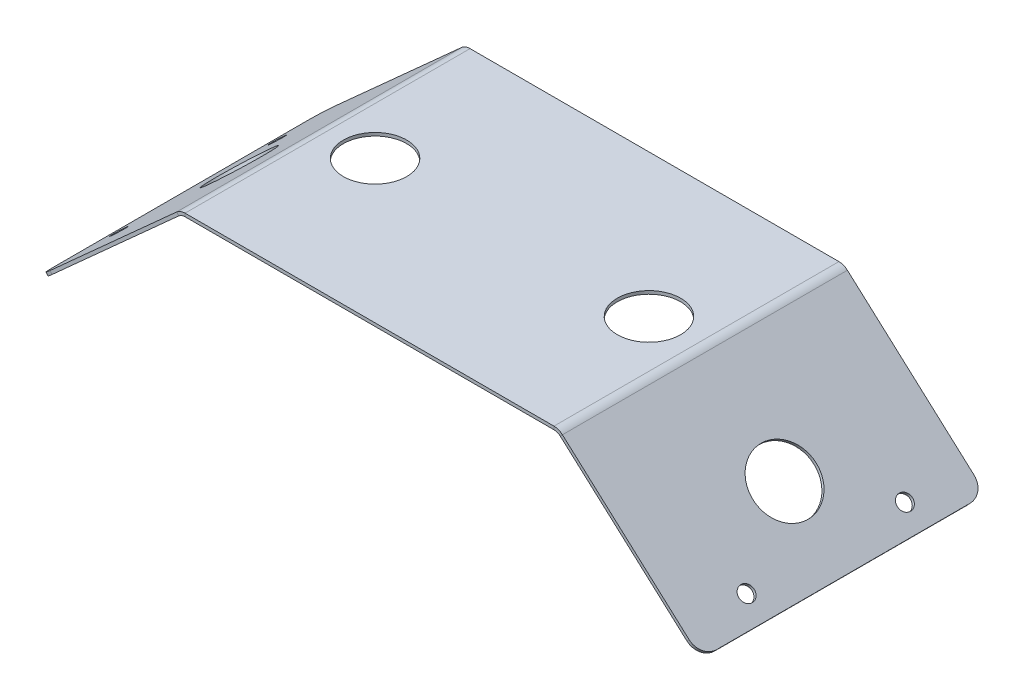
ISO-10303-21;
HEADER;
FILE_DESCRIPTION(('STEP AP214'),'2;1');
FILE_NAME('part.step','',(''),(''),'','','');
FILE_SCHEMA(('AUTOMOTIVE_DESIGN { 1 0 10303 214 1 1 1 1 }'));
ENDSEC;
DATA;
#1=APPLICATION_CONTEXT('core data for automotive mechanical design processes');
#2=APPLICATION_PROTOCOL_DEFINITION('international standard','automotive_design',2000,#1);
#3=PRODUCT_CONTEXT('',#1,'mechanical');
#4=PRODUCT('Part','Part','',(#3));
#5=PRODUCT_RELATED_PRODUCT_CATEGORY('part','',(#4));
#6=PRODUCT_DEFINITION_FORMATION('','',#4);
#7=PRODUCT_DEFINITION_CONTEXT('part definition',#1,'design');
#8=PRODUCT_DEFINITION('design','',#6,#7);
#9=PRODUCT_DEFINITION_SHAPE('','',#8);
#10=(LENGTH_UNIT() NAMED_UNIT(*) SI_UNIT(.MILLI.,.METRE.));
#11=(NAMED_UNIT(*) PLANE_ANGLE_UNIT() SI_UNIT($,.RADIAN.));
#12=(NAMED_UNIT(*) SI_UNIT($,.STERADIAN.) SOLID_ANGLE_UNIT());
#13=UNCERTAINTY_MEASURE_WITH_UNIT(LENGTH_MEASURE(1.E-05),#10,'distance_accuracy_value','');
#14=(GEOMETRIC_REPRESENTATION_CONTEXT(3) GLOBAL_UNCERTAINTY_ASSIGNED_CONTEXT((#13)) GLOBAL_UNIT_ASSIGNED_CONTEXT((#10,
#11,#12)) REPRESENTATION_CONTEXT('',''));
#15=CARTESIAN_POINT('',(0.,0.,0.));
#16=DIRECTION('',(0.,0.,1.));
#17=DIRECTION('',(1.,0.,0.));
#18=AXIS2_PLACEMENT_3D('',#15,#16,#17);
#19=CARTESIAN_POINT('',(-27.4040702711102,29.1563307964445,0.));
#20=DIRECTION('',(0.669130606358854,-0.743144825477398,0.));
#21=DIRECTION('',(0.743144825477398,0.669130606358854,0.));
#22=AXIS2_PLACEMENT_3D('',#19,#20,#21);
#23=PLANE('',#22);
#24=CARTESIAN_POINT('',(-99.0858260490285,-35.3862120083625,-25.));
#25=DIRECTION('',(0.669130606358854,-0.743144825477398,0.));
#26=DIRECTION('',(0.743144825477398,0.669130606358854,0.));
#27=AXIS2_PLACEMENT_3D('',#24,#25,#26);
#28=CIRCLE('',#27,2.39999999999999);
#29=CARTESIAN_POINT('',(-100.869373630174,-36.9921254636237,-25.));
#30=VERTEX_POINT('',#29);
#31=EDGE_CURVE('E775',#30,#30,#28,.T.);
#32=ORIENTED_EDGE('',*,*,#31,.T.);
#33=EDGE_LOOP('',(#32));
#34=FACE_BOUND('',#33,.T.);
#35=DIRECTION('',(-0.743144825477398,-0.669130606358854,0.));
#36=VECTOR('',#35,1.);
#37=CARTESIAN_POINT('',(-27.4040702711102,29.1563307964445,-45.));
#38=LINE('',#37,#36);
#39=CARTESIAN_POINT('',(-60.9265224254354,-1.02742069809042,-45.));
#40=VERTEX_POINT('',#39);
#41=CARTESIAN_POINT('',(-100.943688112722,-37.0590385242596,-45.));
#42=VERTEX_POINT('',#41);
#43=EDGE_CURVE('E214',#40,#42,#38,.T.);
#44=ORIENTED_EDGE('',*,*,#43,.T.);
#45=CARTESIAN_POINT('',(-100.943688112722,-37.0590385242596,-40.));
#46=DIRECTION('',(0.669130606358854,-0.743144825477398,0.));
#47=DIRECTION('',(0.743144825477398,0.669130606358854,0.));
#48=AXIS2_PLACEMENT_3D('',#45,#46,#47);
#49=CIRCLE('',#48,5.);
#50=CARTESIAN_POINT('',(-104.659412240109,-40.4046915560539,-40.));
#51=VERTEX_POINT('',#50);
#52=EDGE_CURVE('E83',#42,#51,#49,.F.);
#53=ORIENTED_EDGE('',*,*,#52,.T.);
#54=DIRECTION('',(0.,0.,1.));
#55=VECTOR('',#54,1.);
#56=CARTESIAN_POINT('',(-104.659412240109,-40.4046915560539,0.));
#57=LINE('',#56,#55);
#58=CARTESIAN_POINT('',(-104.659412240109,-40.4046915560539,40.));
#59=VERTEX_POINT('',#58);
#60=EDGE_CURVE('E220',#51,#59,#57,.T.);
#61=ORIENTED_EDGE('',*,*,#60,.T.);
#62=CARTESIAN_POINT('',(-100.943688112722,-37.0590385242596,40.));
#63=DIRECTION('',(0.669130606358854,-0.743144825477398,0.));
#64=DIRECTION('',(0.743144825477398,0.669130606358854,0.));
#65=AXIS2_PLACEMENT_3D('',#62,#63,#64);
#66=CIRCLE('',#65,5.);
#67=CARTESIAN_POINT('',(-100.943688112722,-37.0590385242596,45.));
#68=VERTEX_POINT('',#67);
#69=EDGE_CURVE('E90',#59,#68,#66,.F.);
#70=ORIENTED_EDGE('',*,*,#69,.T.);
#71=DIRECTION('',(0.743144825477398,0.669130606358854,0.));
#72=VECTOR('',#71,1.);
#73=CARTESIAN_POINT('',(-27.4040702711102,29.1563307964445,45.));
#74=LINE('',#73,#72);
#75=CARTESIAN_POINT('',(-60.9265224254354,-1.02742069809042,45.));
#76=VERTEX_POINT('',#75);
#77=EDGE_CURVE('E216',#68,#76,#74,.T.);
#78=ORIENTED_EDGE('',*,*,#77,.T.);
#79=DIRECTION('',(0.,0.,-1.));
#80=VECTOR('',#79,1.);
#81=CARTESIAN_POINT('',(-60.9265224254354,-1.02742069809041,45.));
#82=LINE('',#81,#80);
#83=EDGE_CURVE('E195',#40,#76,#82,.F.);
#84=ORIENTED_EDGE('',*,*,#83,.F.);
#85=EDGE_LOOP('',(#44,#53,#61,#70,#78,#84));
#86=FACE_BOUND('',#85,.T.);
#87=CARTESIAN_POINT('',(-99.0858260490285,-35.3862120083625,25.));
#88=DIRECTION('',(0.669130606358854,-0.743144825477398,0.));
#89=DIRECTION('',(0.743144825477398,0.669130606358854,0.));
#90=AXIS2_PLACEMENT_3D('',#87,#88,#89);
#91=CIRCLE('',#90,2.39999999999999);
#92=CARTESIAN_POINT('',(-100.869373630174,-36.9921254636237,25.));
#93=VERTEX_POINT('',#92);
#94=EDGE_CURVE('E780',#93,#93,#91,.T.);
#95=ORIENTED_EDGE('',*,*,#94,.T.);
#96=EDGE_LOOP('',(#95));
#97=FACE_BOUND('',#96,.T.);
#98=CARTESIAN_POINT('',(-86.080791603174,-23.6764263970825,0.));
#99=DIRECTION('',(0.669130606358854,-0.743144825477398,0.));
#100=DIRECTION('',(0.743144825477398,0.669130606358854,0.));
#101=AXIS2_PLACEMENT_3D('',#98,#99,#100);
#102=CIRCLE('',#101,10.);
#103=CARTESIAN_POINT('',(-93.512239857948,-30.367732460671,0.));
#104=VERTEX_POINT('',#103);
#105=EDGE_CURVE('E763',#104,#104,#102,.T.);
#106=ORIENTED_EDGE('',*,*,#105,.T.);
#107=EDGE_LOOP('',(#106));
#108=FACE_BOUND('',#107,.T.);
#109=ADVANCED_FACE('F75',(#34,#86,#97,#108),#23,.F.);
#110=CARTESIAN_POINT('',(-26.7349396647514,28.4131859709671,0.));
#111=DIRECTION('',(0.669130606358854,-0.743144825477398,0.));
#112=DIRECTION('',(0.743144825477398,0.669130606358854,0.));
#113=AXIS2_PLACEMENT_3D('',#110,#111,#112);
#114=PLANE('',#113);
#115=CARTESIAN_POINT('',(-98.4166954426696,-36.1293568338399,-25.));
#116=DIRECTION('',(0.669130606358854,-0.743144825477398,0.));
#117=DIRECTION('',(0.743144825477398,0.669130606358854,0.));
#118=AXIS2_PLACEMENT_3D('',#115,#116,#117);
#119=CIRCLE('',#118,2.39999999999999);
#120=CARTESIAN_POINT('',(-100.200243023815,-37.7352702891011,-25.));
#121=VERTEX_POINT('',#120);
#122=EDGE_CURVE('E777',#121,#121,#119,.T.);
#123=ORIENTED_EDGE('',*,*,#122,.F.);
#124=EDGE_LOOP('',(#123));
#125=FACE_BOUND('',#124,.T.);
#126=DIRECTION('',(0.,0.,-1.));
#127=VECTOR('',#126,1.);
#128=CARTESIAN_POINT('',(-103.99028163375,-41.1478363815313,45.));
#129=LINE('',#128,#127);
#130=CARTESIAN_POINT('',(-103.99028163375,-41.1478363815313,-40.));
#131=VERTEX_POINT('',#130);
#132=CARTESIAN_POINT('',(-103.99028163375,-41.1478363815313,40.));
#133=VERTEX_POINT('',#132);
#134=EDGE_CURVE('E224',#131,#133,#129,.F.);
#135=ORIENTED_EDGE('',*,*,#134,.F.);
#136=CARTESIAN_POINT('',(-100.274557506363,-37.802183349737,-40.));
#137=DIRECTION('',(0.669130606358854,-0.743144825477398,0.));
#138=DIRECTION('',(0.743144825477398,0.669130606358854,0.));
#139=AXIS2_PLACEMENT_3D('',#136,#137,#138);
#140=CIRCLE('',#139,5.);
#141=CARTESIAN_POINT('',(-100.274557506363,-37.802183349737,-45.));
#142=VERTEX_POINT('',#141);
#143=EDGE_CURVE('E335',#131,#142,#140,.T.);
#144=ORIENTED_EDGE('',*,*,#143,.T.);
#145=DIRECTION('',(0.743144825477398,0.669130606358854,0.));
#146=VECTOR('',#145,1.);
#147=CARTESIAN_POINT('',(-103.99028163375,-41.1478363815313,-45.));
#148=LINE('',#147,#146);
#149=CARTESIAN_POINT('',(-60.2573918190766,-1.77056552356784,-45.));
#150=VERTEX_POINT('',#149);
#151=EDGE_CURVE('E217',#150,#142,#148,.F.);
#152=ORIENTED_EDGE('',*,*,#151,.F.);
#153=DIRECTION('',(0.,0.,-1.));
#154=VECTOR('',#153,1.);
#155=CARTESIAN_POINT('',(-60.2573918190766,-1.77056552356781,45.));
#156=LINE('',#155,#154);
#157=CARTESIAN_POINT('',(-60.2573918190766,-1.77056552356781,45.));
#158=VERTEX_POINT('',#157);
#159=EDGE_CURVE('E211',#158,#150,#156,.T.);
#160=ORIENTED_EDGE('',*,*,#159,.F.);
#161=DIRECTION('',(-0.743144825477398,-0.669130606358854,0.));
#162=VECTOR('',#161,1.);
#163=CARTESIAN_POINT('',(-59.4015921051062,-1.00000000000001,45.));
#164=LINE('',#163,#162);
#165=CARTESIAN_POINT('',(-100.274557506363,-37.802183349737,45.));
#166=VERTEX_POINT('',#165);
#167=EDGE_CURVE('E221',#166,#158,#164,.F.);
#168=ORIENTED_EDGE('',*,*,#167,.F.);
#169=CARTESIAN_POINT('',(-100.274557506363,-37.802183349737,40.));
#170=DIRECTION('',(0.669130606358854,-0.743144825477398,0.));
#171=DIRECTION('',(0.743144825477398,0.669130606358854,0.));
#172=AXIS2_PLACEMENT_3D('',#169,#170,#171);
#173=CIRCLE('',#172,5.);
#174=EDGE_CURVE('E333',#166,#133,#173,.T.);
#175=ORIENTED_EDGE('',*,*,#174,.T.);
#176=EDGE_LOOP('',(#135,#144,#152,#160,#168,#175));
#177=FACE_BOUND('',#176,.T.);
#178=CARTESIAN_POINT('',(-98.4166954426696,-36.1293568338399,25.));
#179=DIRECTION('',(0.669130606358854,-0.743144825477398,0.));
#180=DIRECTION('',(0.743144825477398,0.669130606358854,0.));
#181=AXIS2_PLACEMENT_3D('',#178,#179,#180);
#182=CIRCLE('',#181,2.39999999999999);
#183=CARTESIAN_POINT('',(-100.200243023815,-37.7352702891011,25.));
#184=VERTEX_POINT('',#183);
#185=EDGE_CURVE('E783',#184,#184,#182,.T.);
#186=ORIENTED_EDGE('',*,*,#185,.F.);
#187=EDGE_LOOP('',(#186));
#188=FACE_BOUND('',#187,.T.);
#189=CARTESIAN_POINT('',(-85.4116609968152,-24.4195712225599,0.));
#190=DIRECTION('',(0.669130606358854,-0.743144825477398,0.));
#191=DIRECTION('',(0.743144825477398,0.669130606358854,0.));
#192=AXIS2_PLACEMENT_3D('',#189,#190,#191);
#193=CIRCLE('',#192,10.);
#194=CARTESIAN_POINT('',(-92.8431092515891,-31.1108772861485,0.));
#195=VERTEX_POINT('',#194);
#196=EDGE_CURVE('E767',#195,#195,#193,.T.);
#197=ORIENTED_EDGE('',*,*,#196,.F.);
#198=EDGE_LOOP('',(#197));
#199=FACE_BOUND('',#198,.T.);
#200=ADVANCED_FACE('F347',(#125,#177,#188,#199),#114,.T.);
#201=CARTESIAN_POINT('',(-58.25,-1.,45.));
#202=DIRECTION('',(0.,0.,1.));
#203=DIRECTION('',(1.,0.,0.));
#204=AXIS2_PLACEMENT_3D('',#201,#202,#203);
#205=PLANE('',#204);
#206=DIRECTION('',(1.,0.,0.));
#207=VECTOR('',#206,1.);
#208=CARTESIAN_POINT('',(-58.25,0.,45.));
#209=LINE('',#208,#207);
#210=CARTESIAN_POINT('',(-58.25,0.,45.));
#211=VERTEX_POINT('',#210);
#212=CARTESIAN_POINT('',(58.25,0.,45.));
#213=VERTEX_POINT('',#212);
#214=EDGE_CURVE('E283',#211,#213,#209,.T.);
#215=ORIENTED_EDGE('',*,*,#214,.F.);
#216=DIRECTION('',(0.,1.,0.));
#217=VECTOR('',#216,1.);
#218=CARTESIAN_POINT('',(-58.25,-1.,45.));
#219=LINE('',#218,#217);
#220=CARTESIAN_POINT('',(-58.25,-1.00000000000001,45.));
#221=VERTEX_POINT('',#220);
#222=EDGE_CURVE('E304',#221,#211,#219,.T.);
#223=ORIENTED_EDGE('',*,*,#222,.F.);
#224=DIRECTION('',(1.,0.,0.));
#225=VECTOR('',#224,1.);
#226=CARTESIAN_POINT('',(-58.25,-1.,45.));
#227=LINE('',#226,#225);
#228=CARTESIAN_POINT('',(58.25,-1.00000000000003,45.));
#229=VERTEX_POINT('',#228);
#230=EDGE_CURVE('E288',#221,#229,#227,.T.);
#231=ORIENTED_EDGE('',*,*,#230,.T.);
#232=DIRECTION('',(0.,1.,0.));
#233=VECTOR('',#232,1.);
#234=CARTESIAN_POINT('',(58.25,-1.,45.));
#235=LINE('',#234,#233);
#236=EDGE_CURVE('E300',#229,#213,#235,.T.);
#237=ORIENTED_EDGE('',*,*,#236,.T.);
#238=EDGE_LOOP('',(#215,#223,#231,#237));
#239=FACE_BOUND('',#238,.T.);
#240=ADVANCED_FACE('F366',(#239),#205,.T.);
#241=CARTESIAN_POINT('',(-58.25,-1.,-45.));
#242=DIRECTION('',(0.,0.,-1.));
#243=DIRECTION('',(-1.,0.,0.));
#244=AXIS2_PLACEMENT_3D('',#241,#242,#243);
#245=PLANE('',#244);
#246=DIRECTION('',(-1.,0.,0.));
#247=VECTOR('',#246,1.);
#248=CARTESIAN_POINT('',(-58.25,0.,-45.));
#249=LINE('',#248,#247);
#250=CARTESIAN_POINT('',(58.25,0.,-45.));
#251=VERTEX_POINT('',#250);
#252=CARTESIAN_POINT('',(-58.25,0.,-45.));
#253=VERTEX_POINT('',#252);
#254=EDGE_CURVE('E294',#251,#253,#249,.T.);
#255=ORIENTED_EDGE('',*,*,#254,.F.);
#256=DIRECTION('',(0.,1.,0.));
#257=VECTOR('',#256,1.);
#258=CARTESIAN_POINT('',(58.25,-1.,-45.));
#259=LINE('',#258,#257);
#260=CARTESIAN_POINT('',(58.25,-1.00000000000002,-44.9999999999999));
#261=VERTEX_POINT('',#260);
#262=EDGE_CURVE('E291',#261,#251,#259,.T.);
#263=ORIENTED_EDGE('',*,*,#262,.F.);
#264=DIRECTION('',(-1.,0.,0.));
#265=VECTOR('',#264,1.);
#266=CARTESIAN_POINT('',(-58.25,-1.,-45.));
#267=LINE('',#266,#265);
#268=CARTESIAN_POINT('',(-58.25,-1.00000000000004,-45.));
#269=VERTEX_POINT('',#268);
#270=EDGE_CURVE('E282',#261,#269,#267,.T.);
#271=ORIENTED_EDGE('',*,*,#270,.T.);
#272=DIRECTION('',(0.,1.,0.));
#273=VECTOR('',#272,1.);
#274=CARTESIAN_POINT('',(-58.25,-1.,-45.));
#275=LINE('',#274,#273);
#276=EDGE_CURVE('E307',#269,#253,#275,.T.);
#277=ORIENTED_EDGE('',*,*,#276,.T.);
#278=EDGE_LOOP('',(#255,#263,#271,#277));
#279=FACE_BOUND('',#278,.T.);
#280=ADVANCED_FACE('F382',(#279),#245,.T.);
#281=CARTESIAN_POINT('',(0.,-1.,0.));
#282=DIRECTION('',(0.,1.,0.));
#283=DIRECTION('',(0.,0.,1.));
#284=AXIS2_PLACEMENT_3D('',#281,#282,#283);
#285=PLANE('',#284);
#286=CARTESIAN_POINT('',(43.25,-1.,0.));
#287=DIRECTION('',(0.,1.,0.));
#288=DIRECTION('',(0.,0.,1.));
#289=AXIS2_PLACEMENT_3D('',#286,#287,#288);
#290=CIRCLE('',#289,10.);
#291=CARTESIAN_POINT('',(43.25,-1.,10.));
#292=VERTEX_POINT('',#291);
#293=EDGE_CURVE('E758',#292,#292,#290,.F.);
#294=ORIENTED_EDGE('',*,*,#293,.F.);
#295=EDGE_LOOP('',(#294));
#296=FACE_BOUND('',#295,.T.);
#297=CARTESIAN_POINT('',(-43.25,-1.,0.));
#298=DIRECTION('',(0.,1.,0.));
#299=DIRECTION('',(0.,0.,1.));
#300=AXIS2_PLACEMENT_3D('',#297,#298,#299);
#301=CIRCLE('',#300,10.);
#302=CARTESIAN_POINT('',(-43.25,-1.,10.));
#303=VERTEX_POINT('',#302);
#304=EDGE_CURVE('E761',#303,#303,#301,.F.);
#305=ORIENTED_EDGE('',*,*,#304,.F.);
#306=EDGE_LOOP('',(#305));
#307=FACE_BOUND('',#306,.T.);
#308=DIRECTION('',(0.,0.,-1.));
#309=VECTOR('',#308,1.);
#310=CARTESIAN_POINT('',(58.25,-1.,-45.));
#311=LINE('',#310,#309);
#312=EDGE_CURVE('E280',#229,#261,#311,.T.);
#313=ORIENTED_EDGE('',*,*,#312,.F.);
#314=ORIENTED_EDGE('',*,*,#230,.F.);
#315=DIRECTION('',(0.,0.,1.));
#316=VECTOR('',#315,1.);
#317=CARTESIAN_POINT('',(-58.25,-1.,-45.));
#318=LINE('',#317,#316);
#319=EDGE_CURVE('E286',#269,#221,#318,.T.);
#320=ORIENTED_EDGE('',*,*,#319,.F.);
#321=ORIENTED_EDGE('',*,*,#270,.F.);
#322=EDGE_LOOP('',(#313,#314,#320,#321));
#323=FACE_BOUND('',#322,.T.);
#324=ADVANCED_FACE('F369',(#296,#307,#323),#285,.F.);
#325=CARTESIAN_POINT('',(0.,0.,0.));
#326=DIRECTION('',(0.,1.,0.));
#327=DIRECTION('',(0.,0.,1.));
#328=AXIS2_PLACEMENT_3D('',#325,#326,#327);
#329=PLANE('',#328);
#330=CARTESIAN_POINT('',(43.25,0.,0.));
#331=DIRECTION('',(0.,1.,0.));
#332=DIRECTION('',(0.,0.,1.));
#333=AXIS2_PLACEMENT_3D('',#330,#331,#332);
#334=CIRCLE('',#333,10.);
#335=CARTESIAN_POINT('',(43.25,0.,10.));
#336=VERTEX_POINT('',#335);
#337=EDGE_CURVE('E825',#336,#336,#334,.T.);
#338=ORIENTED_EDGE('',*,*,#337,.F.);
#339=EDGE_LOOP('',(#338));
#340=FACE_BOUND('',#339,.T.);
#341=CARTESIAN_POINT('',(-43.25,0.,0.));
#342=DIRECTION('',(0.,1.,0.));
#343=DIRECTION('',(0.,0.,1.));
#344=AXIS2_PLACEMENT_3D('',#341,#342,#343);
#345=CIRCLE('',#344,10.);
#346=CARTESIAN_POINT('',(-43.25,0.,10.));
#347=VERTEX_POINT('',#346);
#348=EDGE_CURVE('E764',#347,#347,#345,.T.);
#349=ORIENTED_EDGE('',*,*,#348,.F.);
#350=EDGE_LOOP('',(#349));
#351=FACE_BOUND('',#350,.T.);
#352=DIRECTION('',(0.,0.,-1.));
#353=VECTOR('',#352,1.);
#354=CARTESIAN_POINT('',(58.25,0.,-45.));
#355=LINE('',#354,#353);
#356=EDGE_CURVE('E271',#213,#251,#355,.T.);
#357=ORIENTED_EDGE('',*,*,#356,.T.);
#358=ORIENTED_EDGE('',*,*,#254,.T.);
#359=DIRECTION('',(0.,0.,1.));
#360=VECTOR('',#359,1.);
#361=CARTESIAN_POINT('',(-58.25,0.,-45.));
#362=LINE('',#361,#360);
#363=EDGE_CURVE('E198',#253,#211,#362,.T.);
#364=ORIENTED_EDGE('',*,*,#363,.T.);
#365=ORIENTED_EDGE('',*,*,#214,.T.);
#366=EDGE_LOOP('',(#357,#358,#364,#365));
#367=FACE_BOUND('',#366,.T.);
#368=ADVANCED_FACE('F384',(#340,#351,#367),#329,.T.);
#369=CARTESIAN_POINT('',(58.25,-4.00000000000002,-44.9999999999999));
#370=DIRECTION('',(0.,0.,-1.));
#371=DIRECTION('',(0.,1.,0.));
#372=AXIS2_PLACEMENT_3D('',#369,#370,#371);
#373=PLANE('',#372);
#374=DIRECTION('',(-0.669130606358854,-0.743144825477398,0.));
#375=VECTOR('',#374,1.);
#376=CARTESIAN_POINT('',(60.9265224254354,-1.02742069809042,-45.));
#377=LINE('',#376,#375);
#378=CARTESIAN_POINT('',(60.2573918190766,-1.77056552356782,-44.9999999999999));
#379=VERTEX_POINT('',#378);
#380=CARTESIAN_POINT('',(60.9265224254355,-1.02742069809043,-44.9999999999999));
#381=VERTEX_POINT('',#380);
#382=EDGE_CURVE('E236',#379,#381,#377,.F.);
#383=ORIENTED_EDGE('',*,*,#382,.F.);
#384=CARTESIAN_POINT('',(58.25,-4.00000000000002,-44.9999999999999));
#385=DIRECTION('',(0.,0.,1.));
#386=DIRECTION('',(0.,-1.,0.));
#387=AXIS2_PLACEMENT_3D('',#384,#385,#386);
#388=CIRCLE('',#387,3.);
#389=EDGE_CURVE('E275',#261,#379,#388,.F.);
#390=ORIENTED_EDGE('',*,*,#389,.F.);
#391=ORIENTED_EDGE('',*,*,#262,.T.);
#392=CARTESIAN_POINT('',(58.25,-4.00000000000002,-44.9999999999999));
#393=DIRECTION('',(0.,0.,1.));
#394=DIRECTION('',(0.,-1.,0.));
#395=AXIS2_PLACEMENT_3D('',#392,#393,#394);
#396=CIRCLE('',#395,4.);
#397=EDGE_CURVE('E268',#251,#381,#396,.F.);
#398=ORIENTED_EDGE('',*,*,#397,.T.);
#399=EDGE_LOOP('',(#383,#390,#391,#398));
#400=FACE_BOUND('',#399,.T.);
#401=ADVANCED_FACE('F379',(#400),#373,.T.);
#402=CARTESIAN_POINT('',(58.25,-4.00000000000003,45.));
#403=DIRECTION('',(0.,0.,-1.));
#404=DIRECTION('',(0.,1.,0.));
#405=AXIS2_PLACEMENT_3D('',#402,#403,#404);
#406=PLANE('',#405);
#407=CARTESIAN_POINT('',(58.25,-4.00000000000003,45.));
#408=DIRECTION('',(0.,0.,1.));
#409=DIRECTION('',(0.,-1.,0.));
#410=AXIS2_PLACEMENT_3D('',#407,#408,#409);
#411=CIRCLE('',#410,3.);
#412=CARTESIAN_POINT('',(60.2573918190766,-1.77056552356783,45.));
#413=VERTEX_POINT('',#412);
#414=EDGE_CURVE('E243',#413,#229,#411,.T.);
#415=ORIENTED_EDGE('',*,*,#414,.F.);
#416=DIRECTION('',(-0.669130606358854,-0.743144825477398,0.));
#417=VECTOR('',#416,1.);
#418=CARTESIAN_POINT('',(60.2573918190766,-1.77056552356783,45.));
#419=LINE('',#418,#417);
#420=CARTESIAN_POINT('',(60.9265224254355,-1.02742069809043,45.));
#421=VERTEX_POINT('',#420);
#422=EDGE_CURVE('E261',#413,#421,#419,.F.);
#423=ORIENTED_EDGE('',*,*,#422,.T.);
#424=CARTESIAN_POINT('',(58.25,-4.00000000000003,45.));
#425=DIRECTION('',(0.,0.,1.));
#426=DIRECTION('',(0.,-1.,0.));
#427=AXIS2_PLACEMENT_3D('',#424,#425,#426);
#428=CIRCLE('',#427,4.);
#429=EDGE_CURVE('E272',#421,#213,#428,.T.);
#430=ORIENTED_EDGE('',*,*,#429,.T.);
#431=ORIENTED_EDGE('',*,*,#236,.F.);
#432=EDGE_LOOP('',(#415,#423,#430,#431));
#433=FACE_BOUND('',#432,.T.);
#434=ADVANCED_FACE('F388',(#433),#406,.F.);
#435=CARTESIAN_POINT('',(58.25,-4.00000000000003,45.));
#436=DIRECTION('',(0.,0.,1.));
#437=DIRECTION('',(0.669130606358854,0.743144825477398,0.));
#438=AXIS2_PLACEMENT_3D('',#435,#436,#437);
#439=CYLINDRICAL_SURFACE('',#438,4.);
#440=ORIENTED_EDGE('',*,*,#356,.F.);
#441=ORIENTED_EDGE('',*,*,#429,.F.);
#442=DIRECTION('',(0.,0.,1.));
#443=VECTOR('',#442,1.);
#444=CARTESIAN_POINT('',(60.9265224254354,-1.02742069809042,-45.));
#445=LINE('',#444,#443);
#446=EDGE_CURVE('E258',#421,#381,#445,.F.);
#447=ORIENTED_EDGE('',*,*,#446,.T.);
#448=ORIENTED_EDGE('',*,*,#397,.F.);
#449=EDGE_LOOP('',(#440,#441,#447,#448));
#450=FACE_BOUND('',#449,.T.);
#451=ADVANCED_FACE('F386',(#450),#439,.T.);
#452=CARTESIAN_POINT('',(58.25,-4.00000000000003,45.));
#453=DIRECTION('',(0.,0.,1.));
#454=DIRECTION('',(0.669130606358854,0.743144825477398,0.));
#455=AXIS2_PLACEMENT_3D('',#452,#453,#454);
#456=CYLINDRICAL_SURFACE('',#455,3.);
#457=ORIENTED_EDGE('',*,*,#312,.T.);
#458=ORIENTED_EDGE('',*,*,#389,.T.);
#459=DIRECTION('',(0.,0.,1.));
#460=VECTOR('',#459,1.);
#461=CARTESIAN_POINT('',(60.2573918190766,-1.77056552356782,-45.));
#462=LINE('',#461,#460);
#463=EDGE_CURVE('E264',#379,#413,#462,.T.);
#464=ORIENTED_EDGE('',*,*,#463,.T.);
#465=ORIENTED_EDGE('',*,*,#414,.T.);
#466=EDGE_LOOP('',(#457,#458,#464,#465));
#467=FACE_BOUND('',#466,.T.);
#468=ADVANCED_FACE('F373',(#467),#456,.F.);
#469=CARTESIAN_POINT('',(104.659412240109,-40.4046915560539,45.));
#470=DIRECTION('',(0.,0.,-1.));
#471=DIRECTION('',(-1.,0.,0.));
#472=AXIS2_PLACEMENT_3D('',#469,#470,#471);
#473=PLANE('',#472);
#474=DIRECTION('',(-0.743144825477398,0.669130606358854,0.));
#475=VECTOR('',#474,1.);
#476=CARTESIAN_POINT('',(103.99028163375,-41.1478363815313,45.));
#477=LINE('',#476,#475);
#478=CARTESIAN_POINT('',(100.274557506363,-37.802183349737,45.));
#479=VERTEX_POINT('',#478);
#480=EDGE_CURVE('E255',#413,#479,#477,.F.);
#481=ORIENTED_EDGE('',*,*,#480,.T.);
#482=DIRECTION('',(-0.669130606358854,-0.743144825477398,0.));
#483=VECTOR('',#482,1.);
#484=CARTESIAN_POINT('',(100.943688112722,-37.0590385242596,45.));
#485=LINE('',#484,#483);
#486=CARTESIAN_POINT('',(100.943688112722,-37.0590385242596,45.));
#487=VERTEX_POINT('',#486);
#488=EDGE_CURVE('E319',#479,#487,#485,.F.);
#489=ORIENTED_EDGE('',*,*,#488,.T.);
#490=DIRECTION('',(0.743144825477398,-0.669130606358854,0.));
#491=VECTOR('',#490,1.);
#492=CARTESIAN_POINT('',(27.4040702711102,29.1563307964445,45.));
#493=LINE('',#492,#491);
#494=EDGE_CURVE('E247',#421,#487,#493,.T.);
#495=ORIENTED_EDGE('',*,*,#494,.F.);
#496=ORIENTED_EDGE('',*,*,#422,.F.);
#497=EDGE_LOOP('',(#481,#489,#495,#496));
#498=FACE_BOUND('',#497,.T.);
#499=ADVANCED_FACE('F398',(#498),#473,.F.);
#500=CARTESIAN_POINT('',(60.0707227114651,-0.25685517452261,-45.));
#501=DIRECTION('',(0.,0.,1.));
#502=DIRECTION('',(0.,-1.,0.));
#503=AXIS2_PLACEMENT_3D('',#500,#501,#502);
#504=PLANE('',#503);
#505=DIRECTION('',(-0.743144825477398,0.669130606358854,0.));
#506=VECTOR('',#505,1.);
#507=CARTESIAN_POINT('',(27.4040702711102,29.1563307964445,-45.));
#508=LINE('',#507,#506);
#509=CARTESIAN_POINT('',(100.943688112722,-37.0590385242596,-45.));
#510=VERTEX_POINT('',#509);
#511=EDGE_CURVE('E241',#510,#381,#508,.T.);
#512=ORIENTED_EDGE('',*,*,#511,.F.);
#513=DIRECTION('',(-0.669130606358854,-0.743144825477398,0.));
#514=VECTOR('',#513,1.);
#515=CARTESIAN_POINT('',(100.943688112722,-37.0590385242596,-45.));
#516=LINE('',#515,#514);
#517=CARTESIAN_POINT('',(100.274557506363,-37.802183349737,-45.));
#518=VERTEX_POINT('',#517);
#519=EDGE_CURVE('E325',#510,#518,#516,.T.);
#520=ORIENTED_EDGE('',*,*,#519,.T.);
#521=DIRECTION('',(0.743144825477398,-0.669130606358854,0.));
#522=VECTOR('',#521,1.);
#523=CARTESIAN_POINT('',(59.4015921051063,-1.00000000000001,-45.));
#524=LINE('',#523,#522);
#525=EDGE_CURVE('E250',#518,#379,#524,.F.);
#526=ORIENTED_EDGE('',*,*,#525,.T.);
#527=ORIENTED_EDGE('',*,*,#382,.T.);
#528=EDGE_LOOP('',(#512,#520,#526,#527));
#529=FACE_BOUND('',#528,.T.);
#530=ADVANCED_FACE('F413',(#529),#504,.F.);
#531=CARTESIAN_POINT('',(27.4040702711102,29.1563307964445,0.));
#532=DIRECTION('',(-0.669130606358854,-0.743144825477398,0.));
#533=DIRECTION('',(0.743144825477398,-0.669130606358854,0.));
#534=AXIS2_PLACEMENT_3D('',#531,#532,#533);
#535=PLANE('',#534);
#536=CARTESIAN_POINT('',(86.080791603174,-23.6764263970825,0.));
#537=DIRECTION('',(0.669130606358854,0.743144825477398,0.));
#538=DIRECTION('',(-0.743144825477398,0.669130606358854,0.));
#539=AXIS2_PLACEMENT_3D('',#536,#537,#538);
#540=CIRCLE('',#539,10.);
#541=CARTESIAN_POINT('',(78.6493433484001,-16.985120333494,0.));
#542=VERTEX_POINT('',#541);
#543=EDGE_CURVE('E787',#542,#542,#540,.T.);
#544=ORIENTED_EDGE('',*,*,#543,.F.);
#545=EDGE_LOOP('',(#544));
#546=FACE_BOUND('',#545,.T.);
#547=CARTESIAN_POINT('',(99.0858260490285,-35.3862120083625,-25.));
#548=DIRECTION('',(0.669130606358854,0.743144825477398,0.));
#549=DIRECTION('',(-0.743144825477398,0.669130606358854,0.));
#550=AXIS2_PLACEMENT_3D('',#547,#548,#549);
#551=CIRCLE('',#550,2.39999999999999);
#552=CARTESIAN_POINT('',(97.3022784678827,-33.7802985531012,-25.));
#553=VERTEX_POINT('',#552);
#554=EDGE_CURVE('E792',#553,#553,#551,.T.);
#555=ORIENTED_EDGE('',*,*,#554,.F.);
#556=EDGE_LOOP('',(#555));
#557=FACE_BOUND('',#556,.T.);
#558=CARTESIAN_POINT('',(99.0858260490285,-35.3862120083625,25.));
#559=DIRECTION('',(0.669130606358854,0.743144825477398,0.));
#560=DIRECTION('',(-0.743144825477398,0.669130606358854,0.));
#561=AXIS2_PLACEMENT_3D('',#558,#559,#560);
#562=CIRCLE('',#561,2.39999999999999);
#563=CARTESIAN_POINT('',(97.3022784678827,-33.7802985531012,25.));
#564=VERTEX_POINT('',#563);
#565=EDGE_CURVE('E235',#564,#564,#562,.T.);
#566=ORIENTED_EDGE('',*,*,#565,.F.);
#567=EDGE_LOOP('',(#566));
#568=FACE_BOUND('',#567,.T.);
#569=ORIENTED_EDGE('',*,*,#494,.T.);
#570=CARTESIAN_POINT('',(100.943688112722,-37.0590385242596,40.));
#571=DIRECTION('',(-0.669130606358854,-0.743144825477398,0.));
#572=DIRECTION('',(0.743144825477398,-0.669130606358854,0.));
#573=AXIS2_PLACEMENT_3D('',#570,#571,#572);
#574=CIRCLE('',#573,5.);
#575=CARTESIAN_POINT('',(104.659412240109,-40.4046915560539,40.));
#576=VERTEX_POINT('',#575);
#577=EDGE_CURVE('E323',#487,#576,#574,.F.);
#578=ORIENTED_EDGE('',*,*,#577,.T.);
#579=DIRECTION('',(0.,0.,-1.));
#580=VECTOR('',#579,1.);
#581=CARTESIAN_POINT('',(104.659412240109,-40.4046915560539,0.));
#582=LINE('',#581,#580);
#583=CARTESIAN_POINT('',(104.659412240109,-40.4046915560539,-40.));
#584=VERTEX_POINT('',#583);
#585=EDGE_CURVE('E244',#576,#584,#582,.T.);
#586=ORIENTED_EDGE('',*,*,#585,.T.);
#587=CARTESIAN_POINT('',(100.943688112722,-37.0590385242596,-40.));
#588=DIRECTION('',(-0.669130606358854,-0.743144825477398,0.));
#589=DIRECTION('',(0.743144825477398,-0.669130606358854,0.));
#590=AXIS2_PLACEMENT_3D('',#587,#588,#589);
#591=CIRCLE('',#590,5.);
#592=EDGE_CURVE('E321',#584,#510,#591,.F.);
#593=ORIENTED_EDGE('',*,*,#592,.T.);
#594=ORIENTED_EDGE('',*,*,#511,.T.);
#595=ORIENTED_EDGE('',*,*,#446,.F.);
#596=EDGE_LOOP('',(#569,#578,#586,#593,#594,#595));
#597=FACE_BOUND('',#596,.T.);
#598=ADVANCED_FACE('F395',(#546,#557,#568,#597),#535,.F.);
#599=CARTESIAN_POINT('',(26.7349396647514,28.4131859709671,0.));
#600=DIRECTION('',(-0.669130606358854,-0.743144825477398,0.));
#601=DIRECTION('',(0.743144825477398,-0.669130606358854,0.));
#602=AXIS2_PLACEMENT_3D('',#599,#600,#601);
#603=PLANE('',#602);
#604=CARTESIAN_POINT('',(85.4116609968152,-24.4195712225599,0.));
#605=DIRECTION('',(-0.669130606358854,-0.743144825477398,0.));
#606=DIRECTION('',(0.743144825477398,-0.669130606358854,0.));
#607=AXIS2_PLACEMENT_3D('',#604,#605,#606);
#608=CIRCLE('',#607,10.);
#609=CARTESIAN_POINT('',(92.8431092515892,-31.1108772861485,0.));
#610=VERTEX_POINT('',#609);
#611=EDGE_CURVE('E786',#610,#610,#608,.F.);
#612=ORIENTED_EDGE('',*,*,#611,.T.);
#613=EDGE_LOOP('',(#612));
#614=FACE_BOUND('',#613,.T.);
#615=CARTESIAN_POINT('',(98.4166954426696,-36.1293568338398,-25.));
#616=DIRECTION('',(-0.669130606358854,-0.743144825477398,0.));
#617=DIRECTION('',(0.743144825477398,-0.669130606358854,0.));
#618=AXIS2_PLACEMENT_3D('',#615,#616,#617);
#619=CIRCLE('',#618,2.39999999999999);
#620=CARTESIAN_POINT('',(100.200243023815,-37.7352702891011,-25.));
#621=VERTEX_POINT('',#620);
#622=EDGE_CURVE('E790',#621,#621,#619,.F.);
#623=ORIENTED_EDGE('',*,*,#622,.T.);
#624=EDGE_LOOP('',(#623));
#625=FACE_BOUND('',#624,.T.);
#626=CARTESIAN_POINT('',(98.4166954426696,-36.1293568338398,25.));
#627=DIRECTION('',(-0.669130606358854,-0.743144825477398,0.));
#628=DIRECTION('',(0.743144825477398,-0.669130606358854,0.));
#629=AXIS2_PLACEMENT_3D('',#626,#627,#628);
#630=CIRCLE('',#629,2.39999999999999);
#631=CARTESIAN_POINT('',(100.200243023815,-37.7352702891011,25.));
#632=VERTEX_POINT('',#631);
#633=EDGE_CURVE('E795',#632,#632,#630,.F.);
#634=ORIENTED_EDGE('',*,*,#633,.T.);
#635=EDGE_LOOP('',(#634));
#636=FACE_BOUND('',#635,.T.);
#637=DIRECTION('',(0.,0.,1.));
#638=VECTOR('',#637,1.);
#639=CARTESIAN_POINT('',(103.99028163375,-41.1478363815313,-45.));
#640=LINE('',#639,#638);
#641=CARTESIAN_POINT('',(103.99028163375,-41.1478363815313,40.));
#642=VERTEX_POINT('',#641);
#643=CARTESIAN_POINT('',(103.99028163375,-41.1478363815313,-40.));
#644=VERTEX_POINT('',#643);
#645=EDGE_CURVE('E252',#642,#644,#640,.F.);
#646=ORIENTED_EDGE('',*,*,#645,.F.);
#647=CARTESIAN_POINT('',(100.274557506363,-37.802183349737,40.));
#648=DIRECTION('',(-0.669130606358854,-0.743144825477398,0.));
#649=DIRECTION('',(0.743144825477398,-0.669130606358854,0.));
#650=AXIS2_PLACEMENT_3D('',#647,#648,#649);
#651=CIRCLE('',#650,5.);
#652=EDGE_CURVE('E317',#642,#479,#651,.T.);
#653=ORIENTED_EDGE('',*,*,#652,.T.);
#654=ORIENTED_EDGE('',*,*,#480,.F.);
#655=ORIENTED_EDGE('',*,*,#463,.F.);
#656=ORIENTED_EDGE('',*,*,#525,.F.);
#657=CARTESIAN_POINT('',(100.274557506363,-37.802183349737,-40.));
#658=DIRECTION('',(-0.669130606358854,-0.743144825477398,0.));
#659=DIRECTION('',(0.743144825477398,-0.669130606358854,0.));
#660=AXIS2_PLACEMENT_3D('',#657,#658,#659);
#661=CIRCLE('',#660,5.);
#662=EDGE_CURVE('E315',#518,#644,#661,.T.);
#663=ORIENTED_EDGE('',*,*,#662,.T.);
#664=EDGE_LOOP('',(#646,#653,#654,#655,#656,#663));
#665=FACE_BOUND('',#664,.T.);
#666=ADVANCED_FACE('F416',(#614,#625,#636,#665),#603,.T.);
#667=CARTESIAN_POINT('',(104.659412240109,-40.4046915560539,-45.));
#668=DIRECTION('',(-0.743144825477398,0.669130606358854,0.));
#669=DIRECTION('',(-0.669130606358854,-0.743144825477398,0.));
#670=AXIS2_PLACEMENT_3D('',#667,#668,#669);
#671=PLANE('',#670);
#672=ORIENTED_EDGE('',*,*,#585,.F.);
#673=DIRECTION('',(-0.669130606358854,-0.743144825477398,0.));
#674=VECTOR('',#673,1.);
#675=CARTESIAN_POINT('',(104.659412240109,-40.4046915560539,40.));
#676=LINE('',#675,#674);
#677=EDGE_CURVE('E312',#576,#642,#676,.T.);
#678=ORIENTED_EDGE('',*,*,#677,.T.);
#679=ORIENTED_EDGE('',*,*,#645,.T.);
#680=DIRECTION('',(-0.669130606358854,-0.743144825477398,0.));
#681=VECTOR('',#680,1.);
#682=CARTESIAN_POINT('',(104.659412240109,-40.4046915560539,-40.));
#683=LINE('',#682,#681);
#684=EDGE_CURVE('E303',#644,#584,#683,.F.);
#685=ORIENTED_EDGE('',*,*,#684,.T.);
#686=EDGE_LOOP('',(#672,#678,#679,#685));
#687=FACE_BOUND('',#686,.T.);
#688=ADVANCED_FACE('F406',(#687),#671,.F.);
#689=CARTESIAN_POINT('',(-58.25,-4.,45.));
#690=DIRECTION('',(0.,0.,1.));
#691=DIRECTION('',(0.,-1.,0.));
#692=AXIS2_PLACEMENT_3D('',#689,#690,#691);
#693=PLANE('',#692);
#694=DIRECTION('',(0.669130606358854,-0.743144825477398,0.));
#695=VECTOR('',#694,1.);
#696=CARTESIAN_POINT('',(-60.9265224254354,-1.02742069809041,45.));
#697=LINE('',#696,#695);
#698=EDGE_CURVE('E232',#158,#76,#697,.F.);
#699=ORIENTED_EDGE('',*,*,#698,.F.);
#700=CARTESIAN_POINT('',(-58.25,-4.,45.));
#701=DIRECTION('',(0.,0.,-1.));
#702=DIRECTION('',(0.,1.,0.));
#703=AXIS2_PLACEMENT_3D('',#700,#701,#702);
#704=CIRCLE('',#703,2.99999999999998);
#705=EDGE_CURVE('E202',#221,#158,#704,.F.);
#706=ORIENTED_EDGE('',*,*,#705,.F.);
#707=ORIENTED_EDGE('',*,*,#222,.T.);
#708=CARTESIAN_POINT('',(-58.25,-4.,45.));
#709=DIRECTION('',(0.,0.,-1.));
#710=DIRECTION('',(0.,1.,0.));
#711=AXIS2_PLACEMENT_3D('',#708,#709,#710);
#712=CIRCLE('',#711,3.99999999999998);
#713=EDGE_CURVE('E201',#211,#76,#712,.F.);
#714=ORIENTED_EDGE('',*,*,#713,.T.);
#715=EDGE_LOOP('',(#699,#706,#707,#714));
#716=FACE_BOUND('',#715,.T.);
#717=ADVANCED_FACE('F362',(#716),#693,.T.);
#718=CARTESIAN_POINT('',(-58.25,-4.00000000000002,-45.));
#719=DIRECTION('',(0.,0.,1.));
#720=DIRECTION('',(0.,-1.,0.));
#721=AXIS2_PLACEMENT_3D('',#718,#719,#720);
#722=PLANE('',#721);
#723=CARTESIAN_POINT('',(-58.25,-4.00000000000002,-45.));
#724=DIRECTION('',(0.,0.,-1.));
#725=DIRECTION('',(0.,1.,0.));
#726=AXIS2_PLACEMENT_3D('',#723,#724,#725);
#727=CIRCLE('',#726,2.99999999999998);
#728=EDGE_CURVE('E209',#150,#269,#727,.T.);
#729=ORIENTED_EDGE('',*,*,#728,.F.);
#730=DIRECTION('',(0.669130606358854,-0.743144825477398,0.));
#731=VECTOR('',#730,1.);
#732=CARTESIAN_POINT('',(-60.2573918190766,-1.77056552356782,-45.));
#733=LINE('',#732,#731);
#734=EDGE_CURVE('E206',#150,#40,#733,.F.);
#735=ORIENTED_EDGE('',*,*,#734,.T.);
#736=CARTESIAN_POINT('',(-58.25,-4.00000000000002,-45.));
#737=DIRECTION('',(0.,0.,-1.));
#738=DIRECTION('',(0.,1.,0.));
#739=AXIS2_PLACEMENT_3D('',#736,#737,#738);
#740=CIRCLE('',#739,3.99999999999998);
#741=EDGE_CURVE('E191',#40,#253,#740,.T.);
#742=ORIENTED_EDGE('',*,*,#741,.T.);
#743=ORIENTED_EDGE('',*,*,#276,.F.);
#744=EDGE_LOOP('',(#729,#735,#742,#743));
#745=FACE_BOUND('',#744,.T.);
#746=ADVANCED_FACE('F207',(#745),#722,.F.);
#747=CARTESIAN_POINT('',(-58.25,-4.00000000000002,-45.));
#748=DIRECTION('',(0.,0.,-1.));
#749=DIRECTION('',(-0.669130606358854,0.743144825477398,0.));
#750=AXIS2_PLACEMENT_3D('',#747,#748,#749);
#751=CYLINDRICAL_SURFACE('',#750,3.99999999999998);
#752=ORIENTED_EDGE('',*,*,#363,.F.);
#753=ORIENTED_EDGE('',*,*,#741,.F.);
#754=ORIENTED_EDGE('',*,*,#83,.T.);
#755=ORIENTED_EDGE('',*,*,#713,.F.);
#756=EDGE_LOOP('',(#752,#753,#754,#755));
#757=FACE_BOUND('',#756,.T.);
#758=ADVANCED_FACE('F193',(#757),#751,.T.);
#759=CARTESIAN_POINT('',(-58.25,-4.00000000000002,-45.));
#760=DIRECTION('',(0.,0.,-1.));
#761=DIRECTION('',(-0.669130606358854,0.743144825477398,0.));
#762=AXIS2_PLACEMENT_3D('',#759,#760,#761);
#763=CYLINDRICAL_SURFACE('',#762,2.99999999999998);
#764=ORIENTED_EDGE('',*,*,#319,.T.);
#765=ORIENTED_EDGE('',*,*,#705,.T.);
#766=ORIENTED_EDGE('',*,*,#159,.T.);
#767=ORIENTED_EDGE('',*,*,#728,.T.);
#768=EDGE_LOOP('',(#764,#765,#766,#767));
#769=FACE_BOUND('',#768,.T.);
#770=ADVANCED_FACE('F357',(#769),#763,.F.);
#771=CARTESIAN_POINT('',(-104.659412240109,-40.4046915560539,-45.));
#772=DIRECTION('',(0.,0.,1.));
#773=DIRECTION('',(1.,0.,0.));
#774=AXIS2_PLACEMENT_3D('',#771,#772,#773);
#775=PLANE('',#774);
#776=ORIENTED_EDGE('',*,*,#151,.T.);
#777=DIRECTION('',(0.669130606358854,-0.743144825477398,0.));
#778=VECTOR('',#777,1.);
#779=CARTESIAN_POINT('',(-100.943688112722,-37.0590385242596,-45.));
#780=LINE('',#779,#778);
#781=EDGE_CURVE('E98',#142,#42,#780,.F.);
#782=ORIENTED_EDGE('',*,*,#781,.T.);
#783=ORIENTED_EDGE('',*,*,#43,.F.);
#784=ORIENTED_EDGE('',*,*,#734,.F.);
#785=EDGE_LOOP('',(#776,#782,#783,#784));
#786=FACE_BOUND('',#785,.T.);
#787=ADVANCED_FACE('F219',(#786),#775,.F.);
#788=CARTESIAN_POINT('',(-60.0707227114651,-0.25685517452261,45.));
#789=DIRECTION('',(0.,0.,-1.));
#790=DIRECTION('',(-1.,0.,0.));
#791=AXIS2_PLACEMENT_3D('',#788,#789,#790);
#792=PLANE('',#791);
#793=ORIENTED_EDGE('',*,*,#77,.F.);
#794=DIRECTION('',(0.669130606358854,-0.743144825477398,0.));
#795=VECTOR('',#794,1.);
#796=CARTESIAN_POINT('',(-100.943688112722,-37.0590385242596,45.));
#797=LINE('',#796,#795);
#798=EDGE_CURVE('E13',#68,#166,#797,.T.);
#799=ORIENTED_EDGE('',*,*,#798,.T.);
#800=ORIENTED_EDGE('',*,*,#167,.T.);
#801=ORIENTED_EDGE('',*,*,#698,.T.);
#802=EDGE_LOOP('',(#793,#799,#800,#801));
#803=FACE_BOUND('',#802,.T.);
#804=ADVANCED_FACE('F354',(#803),#792,.F.);
#805=CARTESIAN_POINT('',(-104.659412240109,-40.4046915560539,45.));
#806=DIRECTION('',(0.743144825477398,0.669130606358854,0.));
#807=DIRECTION('',(-0.669130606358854,0.743144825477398,0.));
#808=AXIS2_PLACEMENT_3D('',#805,#806,#807);
#809=PLANE('',#808);
#810=ORIENTED_EDGE('',*,*,#60,.F.);
#811=DIRECTION('',(0.669130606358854,-0.743144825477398,0.));
#812=VECTOR('',#811,1.);
#813=CARTESIAN_POINT('',(-104.659412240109,-40.4046915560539,-40.));
#814=LINE('',#813,#812);
#815=EDGE_CURVE('E330',#51,#131,#814,.T.);
#816=ORIENTED_EDGE('',*,*,#815,.T.);
#817=ORIENTED_EDGE('',*,*,#134,.T.);
#818=DIRECTION('',(0.669130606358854,-0.743144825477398,0.));
#819=VECTOR('',#818,1.);
#820=CARTESIAN_POINT('',(-104.659412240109,-40.4046915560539,40.));
#821=LINE('',#820,#819);
#822=EDGE_CURVE('E328',#133,#59,#821,.F.);
#823=ORIENTED_EDGE('',*,*,#822,.T.);
#824=EDGE_LOOP('',(#810,#816,#817,#823));
#825=FACE_BOUND('',#824,.T.);
#826=ADVANCED_FACE('F342',(#825),#809,.F.);
#827=CARTESIAN_POINT('',(4.99581943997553,-139.883750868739,25.));
#828=DIRECTION('',(0.669130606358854,0.743144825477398,0.));
#829=DIRECTION('',(-0.743144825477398,0.669130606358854,0.));
#830=AXIS2_PLACEMENT_3D('',#827,#828,#829);
#831=CYLINDRICAL_SURFACE('',#830,2.39999999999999);
#832=ORIENTED_EDGE('',*,*,#633,.F.);
#833=EDGE_LOOP('',(#832));
#834=FACE_BOUND('',#833,.T.);
#835=ORIENTED_EDGE('',*,*,#565,.T.);
#836=EDGE_LOOP('',(#835));
#837=FACE_BOUND('',#836,.T.);
#838=ADVANCED_FACE('F440',(#834,#837),#831,.F.);
#839=CARTESIAN_POINT('',(4.99581943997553,-139.883750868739,-25.));
#840=DIRECTION('',(0.669130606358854,0.743144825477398,0.));
#841=DIRECTION('',(-0.743144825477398,0.669130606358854,0.));
#842=AXIS2_PLACEMENT_3D('',#839,#840,#841);
#843=CYLINDRICAL_SURFACE('',#842,2.39999999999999);
#844=ORIENTED_EDGE('',*,*,#622,.F.);
#845=EDGE_LOOP('',(#844));
#846=FACE_BOUND('',#845,.T.);
#847=ORIENTED_EDGE('',*,*,#554,.T.);
#848=EDGE_LOOP('',(#847));
#849=FACE_BOUND('',#848,.T.);
#850=ADVANCED_FACE('F488',(#846,#849),#843,.F.);
#851=CARTESIAN_POINT('',(-8.00921500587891,-128.173965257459,0.));
#852=DIRECTION('',(0.669130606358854,0.743144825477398,0.));
#853=DIRECTION('',(-0.743144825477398,0.669130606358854,0.));
#854=AXIS2_PLACEMENT_3D('',#851,#852,#853);
#855=CYLINDRICAL_SURFACE('',#854,10.);
#856=ORIENTED_EDGE('',*,*,#611,.F.);
#857=EDGE_LOOP('',(#856));
#858=FACE_BOUND('',#857,.T.);
#859=ORIENTED_EDGE('',*,*,#543,.T.);
#860=EDGE_LOOP('',(#859));
#861=FACE_BOUND('',#860,.T.);
#862=ADVANCED_FACE('F495',(#858,#861),#855,.F.);
#863=CARTESIAN_POINT('',(-4.99581943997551,-139.883750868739,25.));
#864=DIRECTION('',(-0.669130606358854,0.743144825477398,0.));
#865=DIRECTION('',(-0.743144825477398,-0.669130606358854,0.));
#866=AXIS2_PLACEMENT_3D('',#863,#864,#865);
#867=CYLINDRICAL_SURFACE('',#866,2.39999999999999);
#868=CARTESIAN_POINT('',(-100.200243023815,-37.7352702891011,25.));
#869=CARTESIAN_POINT('',(-100.207213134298,-37.7275291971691,25.));
#870=CARTESIAN_POINT('',(-100.214183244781,-37.719788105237,25.));
#871=CARTESIAN_POINT('',(-100.228123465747,-37.7043059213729,25.));
#872=CARTESIAN_POINT('',(-100.23509357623,-37.6965648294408,25.));
#873=CARTESIAN_POINT('',(-100.249033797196,-37.6810826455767,25.));
#874=CARTESIAN_POINT('',(-100.256003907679,-37.6733415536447,25.));
#875=CARTESIAN_POINT('',(-100.269944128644,-37.6578593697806,25.));
#876=CARTESIAN_POINT('',(-100.276914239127,-37.6501182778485,25.));
#877=CARTESIAN_POINT('',(-100.290854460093,-37.6346360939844,25.));
#878=CARTESIAN_POINT('',(-100.297824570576,-37.6268950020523,25.));
#879=CARTESIAN_POINT('',(-100.311764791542,-37.6114128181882,25.));
#880=CARTESIAN_POINT('',(-100.318734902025,-37.6036717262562,25.));
#881=CARTESIAN_POINT('',(-100.332675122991,-37.5881895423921,25.));
#882=CARTESIAN_POINT('',(-100.339645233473,-37.58044845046,25.));
#883=CARTESIAN_POINT('',(-100.353585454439,-37.5649662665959,25.));
#884=CARTESIAN_POINT('',(-100.360555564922,-37.5572251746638,25.));
#885=CARTESIAN_POINT('',(-100.374495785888,-37.5417429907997,25.));
#886=CARTESIAN_POINT('',(-100.381465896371,-37.5340018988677,25.));
#887=CARTESIAN_POINT('',(-100.395406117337,-37.5185197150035,25.));
#888=CARTESIAN_POINT('',(-100.40237622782,-37.5107786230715,25.));
#889=CARTESIAN_POINT('',(-100.416316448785,-37.4952964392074,25.));
#890=CARTESIAN_POINT('',(-100.423286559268,-37.4875553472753,25.));
#891=CARTESIAN_POINT('',(-100.437226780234,-37.4720731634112,25.));
#892=CARTESIAN_POINT('',(-100.444196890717,-37.4643320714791,25.));
#893=CARTESIAN_POINT('',(-100.458137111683,-37.448849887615,25.));
#894=CARTESIAN_POINT('',(-100.465107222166,-37.441108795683,25.));
#895=CARTESIAN_POINT('',(-100.479047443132,-37.4256266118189,25.));
#896=CARTESIAN_POINT('',(-100.486017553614,-37.4178855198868,25.));
#897=CARTESIAN_POINT('',(-100.49995777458,-37.4024033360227,25.));
#898=CARTESIAN_POINT('',(-100.506927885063,-37.3946622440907,25.));
#899=CARTESIAN_POINT('',(-100.520868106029,-37.3791800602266,25.));
#900=CARTESIAN_POINT('',(-100.527838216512,-37.3714389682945,25.));
#901=CARTESIAN_POINT('',(-100.541778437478,-37.3559567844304,25.));
#902=CARTESIAN_POINT('',(-100.548748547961,-37.3482156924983,25.));
#903=CARTESIAN_POINT('',(-100.562688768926,-37.3327335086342,25.));
#904=CARTESIAN_POINT('',(-100.569658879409,-37.3249924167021,25.));
#905=CARTESIAN_POINT('',(-100.583599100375,-37.309510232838,25.));
#906=CARTESIAN_POINT('',(-100.590569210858,-37.301769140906,25.));
#907=CARTESIAN_POINT('',(-100.604509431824,-37.2862869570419,25.));
#908=CARTESIAN_POINT('',(-100.611479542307,-37.2785458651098,25.));
#909=CARTESIAN_POINT('',(-100.625419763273,-37.2630636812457,25.));
#910=CARTESIAN_POINT('',(-100.632389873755,-37.2553225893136,25.));
#911=CARTESIAN_POINT('',(-100.646330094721,-37.2398404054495,25.));
#912=CARTESIAN_POINT('',(-100.653300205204,-37.2320993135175,25.));
#913=CARTESIAN_POINT('',(-100.66724042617,-37.2166171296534,25.));
#914=CARTESIAN_POINT('',(-100.674210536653,-37.2088760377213,25.));
#915=CARTESIAN_POINT('',(-100.688150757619,-37.1933938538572,25.));
#916=CARTESIAN_POINT('',(-100.695120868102,-37.1856527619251,25.));
#917=CARTESIAN_POINT('',(-100.709061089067,-37.170170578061,25.));
#918=CARTESIAN_POINT('',(-100.71603119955,-37.162429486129,25.));
#919=CARTESIAN_POINT('',(-100.729971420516,-37.1469473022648,25.));
#920=CARTESIAN_POINT('',(-100.736941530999,-37.1392062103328,25.));
#921=CARTESIAN_POINT('',(-100.750881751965,-37.1237240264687,25.));
#922=CARTESIAN_POINT('',(-100.757851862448,-37.1159829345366,25.));
#923=CARTESIAN_POINT('',(-100.771792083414,-37.1005007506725,25.));
#924=CARTESIAN_POINT('',(-100.778762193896,-37.0927596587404,25.));
#925=CARTESIAN_POINT('',(-100.792702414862,-37.0772774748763,25.));
#926=CARTESIAN_POINT('',(-100.799672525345,-37.0695363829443,25.));
#927=CARTESIAN_POINT('',(-100.813612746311,-37.0540541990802,25.));
#928=CARTESIAN_POINT('',(-100.820582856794,-37.0463131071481,25.));
#929=CARTESIAN_POINT('',(-100.83452307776,-37.030830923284,25.));
#930=CARTESIAN_POINT('',(-100.841493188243,-37.023089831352,25.));
#931=CARTESIAN_POINT('',(-100.855433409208,-37.0076076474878,25.));
#932=CARTESIAN_POINT('',(-100.862403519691,-36.9998665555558,25.));
#933=CARTESIAN_POINT('',(-100.869373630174,-36.9921254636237,25.));
#934=B_SPLINE_CURVE_WITH_KNOTS('',3,(#868,#869,#870,#871,#872,#873,#874,#875,#876,#877,#878,
#879,#880,#881,#882,#883,#884,#885,#886,#887,#888,#889,#890,#891,#892,#893,#894,#895,#896,#897,
#898,#899,#900,#901,#902,#903,#904,#905,#906,#907,#908,#909,#910,#911,#912,#913,#914,#915,#916,
#917,#918,#919,#920,#921,#922,#923,#924,#925,#926,#927,#928,#929,#930,#931,#932,#933),
.UNSPECIFIED.,.F.,.F.,(4,2,2,2,2,2,2,2,2,2,2,2,2,2,2,2,2,2,2,2,2,2,2,2,2,2,2,2,2,2,2,2,4),(0.,
0.0312499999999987,0.0624999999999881,0.093749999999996,0.124999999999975,0.156249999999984,
0.187500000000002,0.218749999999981,0.24999999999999,0.281250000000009,0.312499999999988,
0.343750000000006,0.375000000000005,0.406249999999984,0.437500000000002,0.468749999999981,
0.49999999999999,0.531250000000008,0.562499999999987,0.593749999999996,0.624999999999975,
0.656249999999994,0.687499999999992,0.718749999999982,0.74999999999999,0.781249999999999,
0.812499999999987,0.843749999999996,0.875000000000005,0.906249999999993,0.937500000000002,
0.968749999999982,1.),.UNSPECIFIED.);
#935=EDGE_CURVE('BSEAM502',#184,#93,#934,.T.);
#936=ORIENTED_EDGE('',*,*,#185,.T.);
#937=ORIENTED_EDGE('',*,*,#94,.F.);
#938=ORIENTED_EDGE('',*,*,#935,.T.);
#939=ORIENTED_EDGE('',*,*,#935,.F.);
#940=EDGE_LOOP('',(#936,#938,#937,#939));
#941=FACE_BOUND('',#940,.T.);
#942=ADVANCED_FACE('F502',(#941),#867,.F.);
#943=CARTESIAN_POINT('',(-4.99581943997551,-139.883750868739,-25.));
#944=DIRECTION('',(-0.669130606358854,0.743144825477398,0.));
#945=DIRECTION('',(-0.743144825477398,-0.669130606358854,0.));
#946=AXIS2_PLACEMENT_3D('',#943,#944,#945);
#947=CYLINDRICAL_SURFACE('',#946,2.39999999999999);
#948=CARTESIAN_POINT('',(-100.200243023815,-37.7352702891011,-25.));
#949=CARTESIAN_POINT('',(-100.207213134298,-37.7275291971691,-25.));
#950=CARTESIAN_POINT('',(-100.214183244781,-37.719788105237,-25.));
#951=CARTESIAN_POINT('',(-100.228123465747,-37.7043059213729,-25.));
#952=CARTESIAN_POINT('',(-100.23509357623,-37.6965648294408,-25.));
#953=CARTESIAN_POINT('',(-100.249033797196,-37.6810826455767,-25.));
#954=CARTESIAN_POINT('',(-100.256003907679,-37.6733415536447,-25.));
#955=CARTESIAN_POINT('',(-100.269944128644,-37.6578593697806,-25.));
#956=CARTESIAN_POINT('',(-100.276914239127,-37.6501182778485,-25.));
#957=CARTESIAN_POINT('',(-100.290854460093,-37.6346360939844,-25.));
#958=CARTESIAN_POINT('',(-100.297824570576,-37.6268950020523,-25.));
#959=CARTESIAN_POINT('',(-100.311764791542,-37.6114128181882,-25.));
#960=CARTESIAN_POINT('',(-100.318734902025,-37.6036717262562,-25.));
#961=CARTESIAN_POINT('',(-100.332675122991,-37.5881895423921,-25.));
#962=CARTESIAN_POINT('',(-100.339645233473,-37.58044845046,-25.));
#963=CARTESIAN_POINT('',(-100.353585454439,-37.5649662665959,-25.));
#964=CARTESIAN_POINT('',(-100.360555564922,-37.5572251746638,-25.));
#965=CARTESIAN_POINT('',(-100.374495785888,-37.5417429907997,-25.));
#966=CARTESIAN_POINT('',(-100.381465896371,-37.5340018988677,-25.));
#967=CARTESIAN_POINT('',(-100.395406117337,-37.5185197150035,-25.));
#968=CARTESIAN_POINT('',(-100.40237622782,-37.5107786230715,-25.));
#969=CARTESIAN_POINT('',(-100.416316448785,-37.4952964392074,-25.));
#970=CARTESIAN_POINT('',(-100.423286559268,-37.4875553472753,-25.));
#971=CARTESIAN_POINT('',(-100.437226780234,-37.4720731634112,-25.));
#972=CARTESIAN_POINT('',(-100.444196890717,-37.4643320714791,-25.));
#973=CARTESIAN_POINT('',(-100.458137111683,-37.448849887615,-25.));
#974=CARTESIAN_POINT('',(-100.465107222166,-37.441108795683,-25.));
#975=CARTESIAN_POINT('',(-100.479047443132,-37.4256266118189,-25.));
#976=CARTESIAN_POINT('',(-100.486017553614,-37.4178855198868,-25.));
#977=CARTESIAN_POINT('',(-100.49995777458,-37.4024033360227,-25.));
#978=CARTESIAN_POINT('',(-100.506927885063,-37.3946622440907,-25.));
#979=CARTESIAN_POINT('',(-100.520868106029,-37.3791800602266,-25.));
#980=CARTESIAN_POINT('',(-100.527838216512,-37.3714389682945,-25.));
#981=CARTESIAN_POINT('',(-100.541778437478,-37.3559567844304,-25.));
#982=CARTESIAN_POINT('',(-100.548748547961,-37.3482156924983,-25.));
#983=CARTESIAN_POINT('',(-100.562688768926,-37.3327335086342,-25.));
#984=CARTESIAN_POINT('',(-100.569658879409,-37.3249924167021,-25.));
#985=CARTESIAN_POINT('',(-100.583599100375,-37.309510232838,-25.));
#986=CARTESIAN_POINT('',(-100.590569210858,-37.301769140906,-25.));
#987=CARTESIAN_POINT('',(-100.604509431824,-37.2862869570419,-25.));
#988=CARTESIAN_POINT('',(-100.611479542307,-37.2785458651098,-25.));
#989=CARTESIAN_POINT('',(-100.625419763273,-37.2630636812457,-25.));
#990=CARTESIAN_POINT('',(-100.632389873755,-37.2553225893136,-25.));
#991=CARTESIAN_POINT('',(-100.646330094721,-37.2398404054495,-25.));
#992=CARTESIAN_POINT('',(-100.653300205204,-37.2320993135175,-25.));
#993=CARTESIAN_POINT('',(-100.66724042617,-37.2166171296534,-25.));
#994=CARTESIAN_POINT('',(-100.674210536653,-37.2088760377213,-25.));
#995=CARTESIAN_POINT('',(-100.688150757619,-37.1933938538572,-25.));
#996=CARTESIAN_POINT('',(-100.695120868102,-37.1856527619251,-25.));
#997=CARTESIAN_POINT('',(-100.709061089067,-37.170170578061,-25.));
#998=CARTESIAN_POINT('',(-100.71603119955,-37.162429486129,-25.));
#999=CARTESIAN_POINT('',(-100.729971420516,-37.1469473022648,-25.));
#1000=CARTESIAN_POINT('',(-100.736941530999,-37.1392062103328,-25.));
#1001=CARTESIAN_POINT('',(-100.750881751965,-37.1237240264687,-25.));
#1002=CARTESIAN_POINT('',(-100.757851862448,-37.1159829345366,-25.));
#1003=CARTESIAN_POINT('',(-100.771792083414,-37.1005007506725,-25.));
#1004=CARTESIAN_POINT('',(-100.778762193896,-37.0927596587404,-25.));
#1005=CARTESIAN_POINT('',(-100.792702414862,-37.0772774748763,-25.));
#1006=CARTESIAN_POINT('',(-100.799672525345,-37.0695363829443,-25.));
#1007=CARTESIAN_POINT('',(-100.813612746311,-37.0540541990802,-25.));
#1008=CARTESIAN_POINT('',(-100.820582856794,-37.0463131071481,-25.));
#1009=CARTESIAN_POINT('',(-100.83452307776,-37.030830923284,-25.));
#1010=CARTESIAN_POINT('',(-100.841493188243,-37.023089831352,-25.));
#1011=CARTESIAN_POINT('',(-100.855433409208,-37.0076076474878,-25.));
#1012=CARTESIAN_POINT('',(-100.862403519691,-36.9998665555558,-25.));
#1013=CARTESIAN_POINT('',(-100.869373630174,-36.9921254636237,-25.));
#1014=B_SPLINE_CURVE_WITH_KNOTS('',3,(#948,#949,#950,#951,#952,#953,#954,#955,#956,#957,#958,
#959,#960,#961,#962,#963,#964,#965,#966,#967,#968,#969,#970,#971,#972,#973,#974,#975,#976,#977,
#978,#979,#980,#981,#982,#983,#984,#985,#986,#987,#988,#989,#990,#991,#992,#993,#994,#995,#996,
#997,#998,#999,#1000,#1001,#1002,#1003,#1004,#1005,#1006,#1007,#1008,#1009,#1010,#1011,#1012,
#1013),.UNSPECIFIED.,.F.,.F.,(4,2,2,2,2,2,2,2,2,2,2,2,2,2,2,2,2,2,2,2,2,2,2,2,2,2,2,2,2,2,2,2,
4),(0.,0.0312499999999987,0.0624999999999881,0.093749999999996,0.124999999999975,
0.156249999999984,0.187500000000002,0.218749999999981,0.24999999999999,0.281250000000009,
0.312499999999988,0.343750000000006,0.375000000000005,0.406249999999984,0.437500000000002,
0.468749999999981,0.49999999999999,0.531250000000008,0.562499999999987,0.593749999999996,
0.624999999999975,0.656249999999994,0.687499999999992,0.718749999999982,0.74999999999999,
0.781249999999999,0.812499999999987,0.843749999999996,0.875000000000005,0.906249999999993,
0.937500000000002,0.968749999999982,1.),.UNSPECIFIED.);
#1015=EDGE_CURVE('BSEAM510',#121,#30,#1014,.T.);
#1016=ORIENTED_EDGE('',*,*,#122,.T.);
#1017=ORIENTED_EDGE('',*,*,#31,.F.);
#1018=ORIENTED_EDGE('',*,*,#1015,.T.);
#1019=ORIENTED_EDGE('',*,*,#1015,.F.);
#1020=EDGE_LOOP('',(#1016,#1018,#1017,#1019));
#1021=FACE_BOUND('',#1020,.T.);
#1022=ADVANCED_FACE('F510',(#1021),#947,.F.);
#1023=CARTESIAN_POINT('',(8.00921500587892,-128.173965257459,0.));
#1024=DIRECTION('',(-0.669130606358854,0.743144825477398,0.));
#1025=DIRECTION('',(-0.743144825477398,-0.669130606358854,0.));
#1026=AXIS2_PLACEMENT_3D('',#1023,#1024,#1025);
#1027=CYLINDRICAL_SURFACE('',#1026,10.);
#1028=CARTESIAN_POINT('',(-92.8431092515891,-31.1108772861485,0.));
#1029=CARTESIAN_POINT('',(-92.850079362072,-31.1031361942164,0.));
#1030=CARTESIAN_POINT('',(-92.8570494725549,-31.0953951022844,0.));
#1031=CARTESIAN_POINT('',(-92.8709896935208,-31.0799129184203,0.));
#1032=CARTESIAN_POINT('',(-92.8779598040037,-31.0721718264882,0.));
#1033=CARTESIAN_POINT('',(-92.8919000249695,-31.0566896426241,0.));
#1034=CARTESIAN_POINT('',(-92.8988701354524,-31.048948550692,0.));
#1035=CARTESIAN_POINT('',(-92.9128103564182,-31.0334663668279,0.));
#1036=CARTESIAN_POINT('',(-92.9197804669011,-31.0257252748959,0.));
#1037=CARTESIAN_POINT('',(-92.9337206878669,-31.0102430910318,0.));
#1038=CARTESIAN_POINT('',(-92.9406907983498,-31.0025019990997,0.));
#1039=CARTESIAN_POINT('',(-92.9546310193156,-30.9870198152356,0.));
#1040=CARTESIAN_POINT('',(-92.9616011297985,-30.9792787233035,0.));
#1041=CARTESIAN_POINT('',(-92.9755413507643,-30.9637965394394,0.));
#1042=CARTESIAN_POINT('',(-92.9825114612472,-30.9560554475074,0.));
#1043=CARTESIAN_POINT('',(-92.9964516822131,-30.9405732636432,0.));
#1044=CARTESIAN_POINT('',(-93.003421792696,-30.9328321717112,0.));
#1045=CARTESIAN_POINT('',(-93.0173620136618,-30.9173499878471,0.));
#1046=CARTESIAN_POINT('',(-93.0243321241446,-30.909608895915,0.));
#1047=CARTESIAN_POINT('',(-93.0382723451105,-30.8941267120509,0.));
#1048=CARTESIAN_POINT('',(-93.0452424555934,-30.8863856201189,0.));
#1049=CARTESIAN_POINT('',(-93.0591826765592,-30.8709034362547,0.));
#1050=CARTESIAN_POINT('',(-93.0661527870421,-30.8631623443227,0.));
#1051=CARTESIAN_POINT('',(-93.0800930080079,-30.8476801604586,0.));
#1052=CARTESIAN_POINT('',(-93.0870631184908,-30.8399390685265,0.));
#1053=CARTESIAN_POINT('',(-93.1010033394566,-30.8244568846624,0.));
#1054=CARTESIAN_POINT('',(-93.1079734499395,-30.8167157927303,0.));
#1055=CARTESIAN_POINT('',(-93.1219136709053,-30.8012336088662,0.));
#1056=CARTESIAN_POINT('',(-93.1288837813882,-30.7934925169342,0.));
#1057=CARTESIAN_POINT('',(-93.142824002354,-30.7780103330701,0.));
#1058=CARTESIAN_POINT('',(-93.149794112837,-30.770269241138,0.));
#1059=CARTESIAN_POINT('',(-93.1637343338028,-30.7547870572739,0.));
#1060=CARTESIAN_POINT('',(-93.1707044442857,-30.7470459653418,0.));
#1061=CARTESIAN_POINT('',(-93.1846446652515,-30.7315637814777,0.));
#1062=CARTESIAN_POINT('',(-93.1916147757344,-30.7238226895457,0.));
#1063=CARTESIAN_POINT('',(-93.2055549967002,-30.7083405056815,0.));
#1064=CARTESIAN_POINT('',(-93.2125251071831,-30.7005994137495,0.));
#1065=CARTESIAN_POINT('',(-93.2264653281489,-30.6851172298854,0.));
#1066=CARTESIAN_POINT('',(-93.2334354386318,-30.6773761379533,0.));
#1067=CARTESIAN_POINT('',(-93.2473756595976,-30.6618939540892,0.));
#1068=CARTESIAN_POINT('',(-93.2543457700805,-30.6541528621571,0.));
#1069=CARTESIAN_POINT('',(-93.2682859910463,-30.638670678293,0.));
#1070=CARTESIAN_POINT('',(-93.2752561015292,-30.630929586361,0.));
#1071=CARTESIAN_POINT('',(-93.2891963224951,-30.6154474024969,0.));
#1072=CARTESIAN_POINT('',(-93.296166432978,-30.6077063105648,0.));
#1073=CARTESIAN_POINT('',(-93.3101066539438,-30.5922241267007,0.));
#1074=CARTESIAN_POINT('',(-93.3170767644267,-30.5844830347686,0.));
#1075=CARTESIAN_POINT('',(-93.3310169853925,-30.5690008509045,0.));
#1076=CARTESIAN_POINT('',(-93.3379870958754,-30.5612597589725,0.));
#1077=CARTESIAN_POINT('',(-93.3519273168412,-30.5457775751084,0.));
#1078=CARTESIAN_POINT('',(-93.3588974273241,-30.5380364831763,0.));
#1079=CARTESIAN_POINT('',(-93.3728376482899,-30.5225542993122,0.));
#1080=CARTESIAN_POINT('',(-93.3798077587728,-30.5148132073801,0.));
#1081=CARTESIAN_POINT('',(-93.3937479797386,-30.499331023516,0.));
#1082=CARTESIAN_POINT('',(-93.4007180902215,-30.491589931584,0.));
#1083=CARTESIAN_POINT('',(-93.4146583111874,-30.4761077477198,0.));
#1084=CARTESIAN_POINT('',(-93.4216284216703,-30.4683666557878,0.));
#1085=CARTESIAN_POINT('',(-93.4355686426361,-30.4528844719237,0.));
#1086=CARTESIAN_POINT('',(-93.442538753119,-30.4451433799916,0.));
#1087=CARTESIAN_POINT('',(-93.4564789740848,-30.4296611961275,0.));
#1088=CARTESIAN_POINT('',(-93.4634490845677,-30.4219201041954,0.));
#1089=CARTESIAN_POINT('',(-93.4773893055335,-30.4064379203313,0.));
#1090=CARTESIAN_POINT('',(-93.4843594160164,-30.3986968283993,0.));
#1091=CARTESIAN_POINT('',(-93.4982996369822,-30.3832146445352,0.));
#1092=CARTESIAN_POINT('',(-93.5052697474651,-30.3754735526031,0.));
#1093=CARTESIAN_POINT('',(-93.512239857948,-30.367732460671,0.));
#1094=B_SPLINE_CURVE_WITH_KNOTS('',3,(#1028,#1029,#1030,#1031,#1032,#1033,#1034,#1035,#1036,
#1037,#1038,#1039,#1040,#1041,#1042,#1043,#1044,#1045,#1046,#1047,#1048,#1049,#1050,#1051,#1052,
#1053,#1054,#1055,#1056,#1057,#1058,#1059,#1060,#1061,#1062,#1063,#1064,#1065,#1066,#1067,#1068,
#1069,#1070,#1071,#1072,#1073,#1074,#1075,#1076,#1077,#1078,#1079,#1080,#1081,#1082,#1083,#1084,
#1085,#1086,#1087,#1088,#1089,#1090,#1091,#1092,#1093),.UNSPECIFIED.,.F.,.F.,(4,2,2,2,2,2,2,2,2,
2,2,2,2,2,2,2,2,2,2,2,2,2,2,2,2,2,2,2,2,2,2,2,4),(0.,0.031250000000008,0.0624999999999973,
0.093749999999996,0.125000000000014,0.156249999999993,0.187500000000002,0.218750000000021,
0.250000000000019,0.281250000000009,0.312500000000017,0.343750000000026,0.375000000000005,
0.406250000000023,0.437500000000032,0.468750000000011,0.500000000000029,0.531250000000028,
0.562500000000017,0.593750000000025,0.625000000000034,0.656250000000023,0.687500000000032,
0.718750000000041,0.750000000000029,0.781250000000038,0.812500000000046,0.843750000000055,
0.875000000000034,0.906250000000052,0.937500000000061,0.96875000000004,1.00000000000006),.UNSPECIFIED.);
#1095=EDGE_CURVE('BSEAM518',#195,#104,#1094,.T.);
#1096=ORIENTED_EDGE('',*,*,#196,.T.);
#1097=ORIENTED_EDGE('',*,*,#105,.F.);
#1098=ORIENTED_EDGE('',*,*,#1095,.T.);
#1099=ORIENTED_EDGE('',*,*,#1095,.F.);
#1100=EDGE_LOOP('',(#1096,#1098,#1097,#1099));
#1101=FACE_BOUND('',#1100,.T.);
#1102=ADVANCED_FACE('F518',(#1101),#1027,.F.);
#1103=CARTESIAN_POINT('',(100.943688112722,-37.0590385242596,40.));
#1104=DIRECTION('',(-0.669130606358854,-0.743144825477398,0.));
#1105=DIRECTION('',(0.743144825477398,-0.669130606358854,0.));
#1106=AXIS2_PLACEMENT_3D('',#1103,#1104,#1105);
#1107=CYLINDRICAL_SURFACE('',#1106,5.);
#1108=ORIENTED_EDGE('',*,*,#577,.F.);
#1109=ORIENTED_EDGE('',*,*,#488,.F.);
#1110=ORIENTED_EDGE('',*,*,#652,.F.);
#1111=ORIENTED_EDGE('',*,*,#677,.F.);
#1112=EDGE_LOOP('',(#1108,#1109,#1110,#1111));
#1113=FACE_BOUND('',#1112,.T.);
#1114=ADVANCED_FACE('F401',(#1113),#1107,.T.);
#1115=CARTESIAN_POINT('',(100.943688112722,-37.0590385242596,-40.));
#1116=DIRECTION('',(-0.669130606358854,-0.743144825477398,0.));
#1117=DIRECTION('',(0.743144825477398,-0.669130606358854,0.));
#1118=AXIS2_PLACEMENT_3D('',#1115,#1116,#1117);
#1119=CYLINDRICAL_SURFACE('',#1118,5.);
#1120=ORIENTED_EDGE('',*,*,#592,.F.);
#1121=ORIENTED_EDGE('',*,*,#684,.F.);
#1122=ORIENTED_EDGE('',*,*,#662,.F.);
#1123=ORIENTED_EDGE('',*,*,#519,.F.);
#1124=EDGE_LOOP('',(#1120,#1121,#1122,#1123));
#1125=FACE_BOUND('',#1124,.T.);
#1126=ADVANCED_FACE('F410',(#1125),#1119,.T.);
#1127=CARTESIAN_POINT('',(-100.943688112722,-37.0590385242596,-40.));
#1128=DIRECTION('',(0.669130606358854,-0.743144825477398,0.));
#1129=DIRECTION('',(0.743144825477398,0.669130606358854,0.));
#1130=AXIS2_PLACEMENT_3D('',#1127,#1128,#1129);
#1131=CYLINDRICAL_SURFACE('',#1130,5.);
#1132=ORIENTED_EDGE('',*,*,#52,.F.);
#1133=ORIENTED_EDGE('',*,*,#781,.F.);
#1134=ORIENTED_EDGE('',*,*,#143,.F.);
#1135=ORIENTED_EDGE('',*,*,#815,.F.);
#1136=EDGE_LOOP('',(#1132,#1133,#1134,#1135));
#1137=FACE_BOUND('',#1136,.T.);
#1138=ADVANCED_FACE('F345',(#1137),#1131,.T.);
#1139=CARTESIAN_POINT('',(-100.943688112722,-37.0590385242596,40.));
#1140=DIRECTION('',(0.669130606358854,-0.743144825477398,0.));
#1141=DIRECTION('',(0.743144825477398,0.669130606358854,0.));
#1142=AXIS2_PLACEMENT_3D('',#1139,#1140,#1141);
#1143=CYLINDRICAL_SURFACE('',#1142,5.);
#1144=ORIENTED_EDGE('',*,*,#69,.F.);
#1145=ORIENTED_EDGE('',*,*,#822,.F.);
#1146=ORIENTED_EDGE('',*,*,#174,.F.);
#1147=ORIENTED_EDGE('',*,*,#798,.F.);
#1148=EDGE_LOOP('',(#1144,#1145,#1146,#1147));
#1149=FACE_BOUND('',#1148,.T.);
#1150=ADVANCED_FACE('F77',(#1149),#1143,.T.);
#1151=CARTESIAN_POINT('',(-43.25,-41.1488363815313,0.));
#1152=DIRECTION('',(0.,1.,0.));
#1153=DIRECTION('',(0.,0.,1.));
#1154=AXIS2_PLACEMENT_3D('',#1151,#1152,#1153);
#1155=CYLINDRICAL_SURFACE('',#1154,10.);
#1156=ORIENTED_EDGE('',*,*,#348,.T.);
#1157=EDGE_LOOP('',(#1156));
#1158=FACE_BOUND('',#1157,.T.);
#1159=ORIENTED_EDGE('',*,*,#304,.T.);
#1160=EDGE_LOOP('',(#1159));
#1161=FACE_BOUND('',#1160,.T.);
#1162=ADVANCED_FACE('F549',(#1158,#1161),#1155,.F.);
#1163=CARTESIAN_POINT('',(43.25,-41.1488363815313,0.));
#1164=DIRECTION('',(0.,1.,0.));
#1165=DIRECTION('',(0.,0.,1.));
#1166=AXIS2_PLACEMENT_3D('',#1163,#1164,#1165);
#1167=CYLINDRICAL_SURFACE('',#1166,10.);
#1168=ORIENTED_EDGE('',*,*,#337,.T.);
#1169=EDGE_LOOP('',(#1168));
#1170=FACE_BOUND('',#1169,.T.);
#1171=ORIENTED_EDGE('',*,*,#293,.T.);
#1172=EDGE_LOOP('',(#1171));
#1173=FACE_BOUND('',#1172,.T.);
#1174=ADVANCED_FACE('F556',(#1170,#1173),#1167,.F.);
#1175=CLOSED_SHELL('',(#109,#200,#240,#280,#324,#368,#401,#434,#451,#468,#499,#530,#598,#666,
#688,#717,#746,#758,#770,#787,#804,#826,#838,#850,#862,#942,#1022,#1102,#1114,#1126,#1138,#1150,
#1162,#1174));
#1176=MANIFOLD_SOLID_BREP('B2',#1175);
#1177=ADVANCED_BREP_SHAPE_REPRESENTATION('',(#18,#1176),#14);
#1178=SHAPE_DEFINITION_REPRESENTATION(#9,#1177);
ENDSEC;
END-ISO-10303-21;
